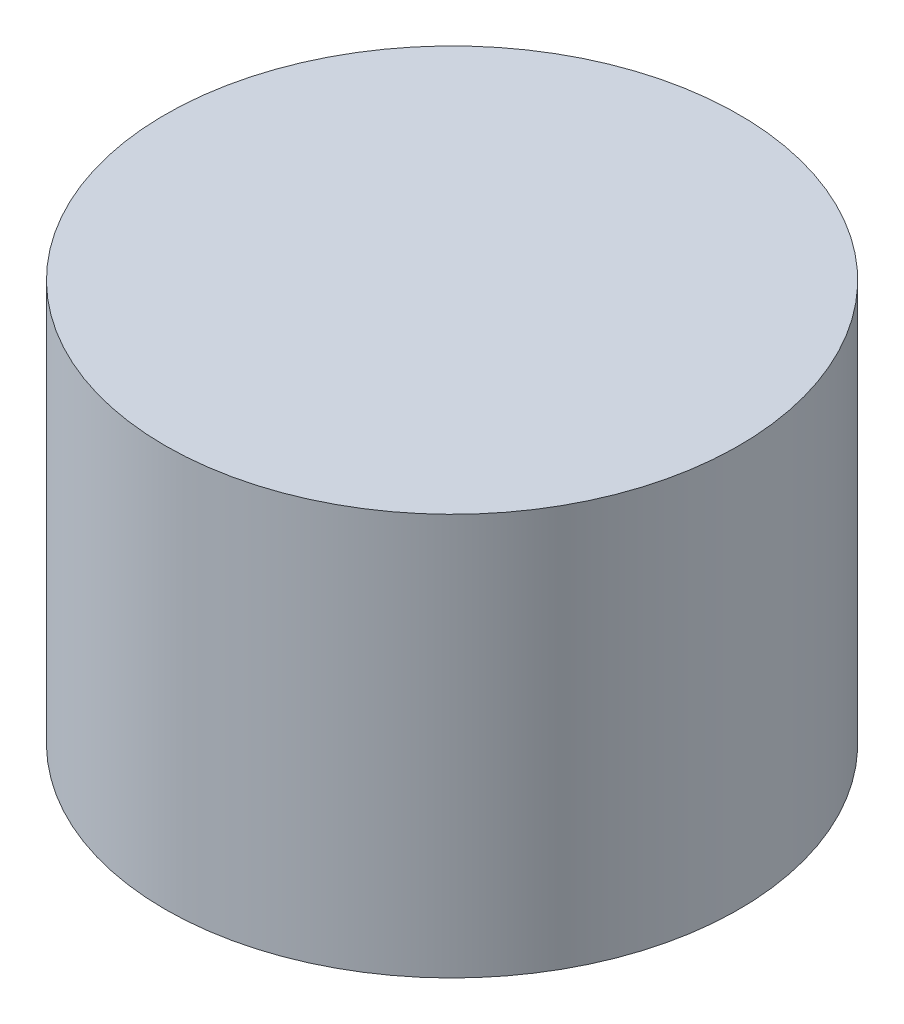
from build123d import *

# Parameters (mm, degrees)
SKETCH1_R           = 25
BOSS_EXTRUDE1_DEPTH = 35
SCALE1_SCALE        = 0.9


with BuildPart() as part:
    # Sketch1 → Boss-Extrude1 (new body)
    with BuildSketch(Plane(origin=(0, 0, 0), x_dir=(1, 0, 0), z_dir=(0, 1, 0))):
        with Locations(Location((0, 0, 0), (0, 0, 270))):
            Circle(SKETCH1_R)
    extrude(amount=BOSS_EXTRUDE1_DEPTH)


with BuildPart() as part_1:
    # Scale1: scaled about (0, 17.5, 0)
    add(part.part.scale(SCALE1_SCALE).moved(Location((0, 1.75, 0))))


solid = part_1.part
